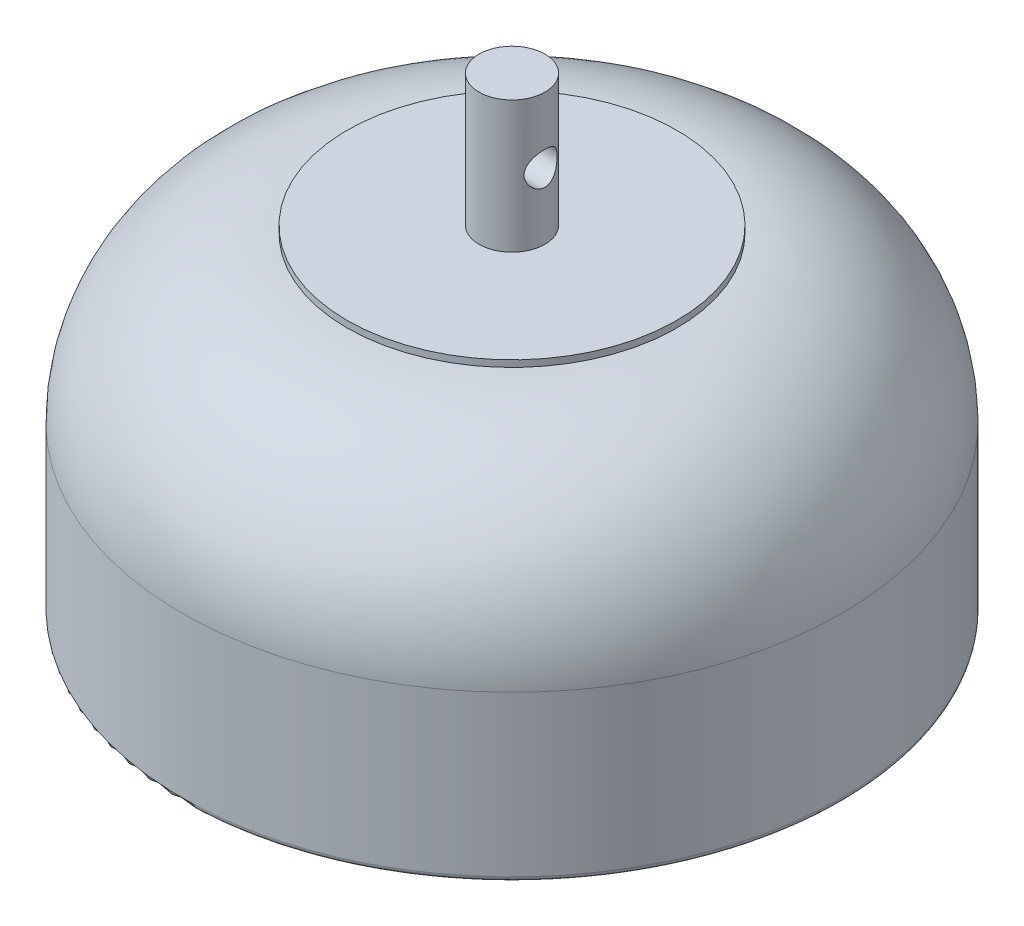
ISO-10303-21;
HEADER;
FILE_DESCRIPTION(('STEP AP214'),'2;1');
FILE_NAME('part.step','',(''),(''),'','','');
FILE_SCHEMA(('AUTOMOTIVE_DESIGN { 1 0 10303 214 1 1 1 1 }'));
ENDSEC;
DATA;
#1=APPLICATION_CONTEXT('core data for automotive mechanical design processes');
#2=APPLICATION_PROTOCOL_DEFINITION('international standard','automotive_design',2000,#1);
#3=PRODUCT_CONTEXT('',#1,'mechanical');
#4=PRODUCT('Part','Part','',(#3));
#5=PRODUCT_RELATED_PRODUCT_CATEGORY('part','',(#4));
#6=PRODUCT_DEFINITION_FORMATION('','',#4);
#7=PRODUCT_DEFINITION_CONTEXT('part definition',#1,'design');
#8=PRODUCT_DEFINITION('design','',#6,#7);
#9=PRODUCT_DEFINITION_SHAPE('','',#8);
#10=(LENGTH_UNIT() NAMED_UNIT(*) SI_UNIT(.MILLI.,.METRE.));
#11=(NAMED_UNIT(*) PLANE_ANGLE_UNIT() SI_UNIT($,.RADIAN.));
#12=(NAMED_UNIT(*) SI_UNIT($,.STERADIAN.) SOLID_ANGLE_UNIT());
#13=UNCERTAINTY_MEASURE_WITH_UNIT(LENGTH_MEASURE(1.E-05),#10,'distance_accuracy_value','');
#14=(GEOMETRIC_REPRESENTATION_CONTEXT(3) GLOBAL_UNCERTAINTY_ASSIGNED_CONTEXT((#13)) GLOBAL_UNIT_ASSIGNED_CONTEXT((#10,
#11,#12)) REPRESENTATION_CONTEXT('',''));
#15=CARTESIAN_POINT('',(0.,0.,0.));
#16=DIRECTION('',(0.,0.,1.));
#17=DIRECTION('',(1.,0.,0.));
#18=AXIS2_PLACEMENT_3D('',#15,#16,#17);
#19=CARTESIAN_POINT('',(0.,72.,0.));
#20=DIRECTION('',(0.,-1.,0.));
#21=DIRECTION('',(0.,0.,-1.));
#22=AXIS2_PLACEMENT_3D('',#19,#20,#21);
#23=CYLINDRICAL_SURFACE('',#22,10.);
#24=CARTESIAN_POINT('',(0.,72.,0.));
#25=DIRECTION('',(0.,1.,0.));
#26=DIRECTION('',(0.,0.,1.));
#27=AXIS2_PLACEMENT_3D('',#24,#25,#26);
#28=CIRCLE('',#27,10.);
#29=CARTESIAN_POINT('',(0.,72.,10.));
#30=VERTEX_POINT('',#29);
#31=EDGE_CURVE('E60',#30,#30,#28,.T.);
#32=ORIENTED_EDGE('',*,*,#31,.F.);
#33=EDGE_LOOP('',(#32));
#34=FACE_BOUND('',#33,.T.);
#35=CARTESIAN_POINT('',(0.,32.,0.));
#36=DIRECTION('',(0.,1.,0.));
#37=DIRECTION('',(0.,0.,1.));
#38=AXIS2_PLACEMENT_3D('',#35,#36,#37);
#39=CIRCLE('',#38,10.);
#40=CARTESIAN_POINT('',(0.,32.,10.));
#41=VERTEX_POINT('',#40);
#42=EDGE_CURVE('E11',#41,#41,#39,.T.);
#43=ORIENTED_EDGE('',*,*,#42,.T.);
#44=EDGE_LOOP('',(#43));
#45=FACE_BOUND('',#44,.T.);
#46=CARTESIAN_POINT('',(-8.66025403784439,52.,5.));
#47=CARTESIAN_POINT('',(-8.66025482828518,52.1303316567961,4.99999937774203));
#48=CARTESIAN_POINT('',(-8.66320639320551,52.2606749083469,4.99489703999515));
#49=CARTESIAN_POINT('',(-8.67490215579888,52.5203552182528,4.97455590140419));
#50=CARTESIAN_POINT('',(-8.68364905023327,52.6496917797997,4.95931238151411));
#51=CARTESIAN_POINT('',(-8.70662912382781,52.9065135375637,4.91885673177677));
#52=CARTESIAN_POINT('',(-8.72087090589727,53.033995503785,4.89362896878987));
#53=CARTESIAN_POINT('',(-8.75432466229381,53.2860174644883,4.83352579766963));
#54=CARTESIAN_POINT('',(-8.77353879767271,53.410556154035,4.79864619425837));
#55=CARTESIAN_POINT('',(-8.83745677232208,53.7771112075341,4.6805346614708));
#56=CARTESIAN_POINT('',(-8.88859880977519,54.0137323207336,4.58356144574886));
#57=CARTESIAN_POINT('',(-9.00213659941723,54.4671619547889,4.35632594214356));
#58=CARTESIAN_POINT('',(-9.06453296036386,54.6839694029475,4.22606185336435));
#59=CARTESIAN_POINT('',(-9.19984032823,55.1115106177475,3.92334549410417));
#60=CARTESIAN_POINT('',(-9.27319410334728,55.3202685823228,3.74829976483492));
#61=CARTESIAN_POINT('',(-9.41860822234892,55.7070690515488,3.36622943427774));
#62=CARTESIAN_POINT('',(-9.49066790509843,55.8850962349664,3.15918897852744));
#63=CARTESIAN_POINT('',(-9.59484443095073,56.1312264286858,2.82033206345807));
#64=CARTESIAN_POINT('',(-9.62993554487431,56.2119131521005,2.69838192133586));
#65=CARTESIAN_POINT('',(-9.69680156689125,56.3626286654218,2.44722131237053));
#66=CARTESIAN_POINT('',(-9.72857779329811,56.4326616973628,2.31801376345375));
#67=CARTESIAN_POINT('',(-9.78789520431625,56.5613762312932,2.05317391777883));
#68=CARTESIAN_POINT('',(-9.81543747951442,56.6200606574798,1.91754328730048));
#69=CARTESIAN_POINT('',(-9.86547242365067,56.7254310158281,1.64079696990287));
#70=CARTESIAN_POINT('',(-9.88796562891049,56.7721182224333,1.49968186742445));
#71=CARTESIAN_POINT('',(-9.92580359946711,56.8500155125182,1.2233043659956));
#72=CARTESIAN_POINT('',(-9.94154295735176,56.8820901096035,1.08833937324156));
#73=CARTESIAN_POINT('',(-9.96761571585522,56.9349664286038,0.815709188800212));
#74=CARTESIAN_POINT('',(-9.97794964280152,56.9557692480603,0.678044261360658));
#75=CARTESIAN_POINT('',(-9.99290900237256,56.9858199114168,0.40121705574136));
#76=CARTESIAN_POINT('',(-9.99753719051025,56.9950733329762,0.262055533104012));
#77=CARTESIAN_POINT('',(-10.0009568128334,57.0019143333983,-0.0166220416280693));
#78=CARTESIAN_POINT('',(-9.99974860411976,56.9995026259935,-0.156138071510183));
#79=CARTESIAN_POINT('',(-9.99189263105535,56.9837693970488,-0.422158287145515));
#80=CARTESIAN_POINT('',(-9.9857287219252,56.9714182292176,-0.548735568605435));
#81=CARTESIAN_POINT('',(-9.9687211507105,56.9371674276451,-0.800312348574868));
#82=CARTESIAN_POINT('',(-9.95787601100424,56.915264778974,-0.925311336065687));
#83=CARTESIAN_POINT('',(-9.93176736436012,56.8621537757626,-1.17280363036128));
#84=CARTESIAN_POINT('',(-9.91650533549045,56.8309485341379,-1.29529776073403));
#85=CARTESIAN_POINT('',(-9.88192155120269,56.7595523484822,-1.53706747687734));
#86=CARTESIAN_POINT('',(-9.86259824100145,56.7193579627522,-1.6563418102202));
#87=CARTESIAN_POINT('',(-9.79859222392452,56.5846254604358,-2.01140340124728));
#88=CARTESIAN_POINT('',(-9.74822622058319,56.4766310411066,-2.24122720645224));
#89=CARTESIAN_POINT('',(-9.63687815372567,56.2286703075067,-2.67992393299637));
#90=CARTESIAN_POINT('',(-9.57589229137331,56.088692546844,-2.88878931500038));
#91=CARTESIAN_POINT('',(-9.44222356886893,55.7655365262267,-3.30085071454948));
#92=CARTESIAN_POINT('',(-9.36897995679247,55.5795253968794,-3.50164452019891));
#93=CARTESIAN_POINT('',(-9.22270586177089,55.1770108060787,-3.87054772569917));
#94=CARTESIAN_POINT('',(-9.14967558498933,54.9604841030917,-4.03863197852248));
#95=CARTESIAN_POINT('',(-9.04390911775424,54.6088064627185,-4.2679539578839));
#96=CARTESIAN_POINT('',(-9.00829977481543,54.4829490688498,-4.34240098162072));
#97=CARTESIAN_POINT('',(-8.94051483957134,54.2244861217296,-4.48030007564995));
#98=CARTESIAN_POINT('',(-8.90833780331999,54.0918834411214,-4.54375677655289));
#99=CARTESIAN_POINT('',(-8.84860631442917,53.8207965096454,-4.65901104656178));
#100=CARTESIAN_POINT('',(-8.82104906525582,53.6823158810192,-4.71081567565));
#101=CARTESIAN_POINT('',(-8.7716484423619,53.4003786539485,-4.80217514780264));
#102=CARTESIAN_POINT('',(-8.74980428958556,53.2569227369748,-4.84173166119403));
#103=CARTESIAN_POINT('',(-8.71426171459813,52.9777430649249,-4.90539138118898));
#104=CARTESIAN_POINT('',(-8.7000553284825,52.8423062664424,-4.93047005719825));
#105=CARTESIAN_POINT('',(-8.67788216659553,52.5693280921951,-4.96939299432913));
#106=CARTESIAN_POINT('',(-8.66991462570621,52.4317869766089,-4.98323863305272));
#107=CARTESIAN_POINT('',(-8.66056020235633,52.1558845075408,-4.99947854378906));
#108=CARTESIAN_POINT('',(-8.65916956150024,52.01752366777,-5.00187935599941));
#109=CARTESIAN_POINT('',(-8.66301922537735,51.7411790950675,-4.99520900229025));
#110=CARTESIAN_POINT('',(-8.66825908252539,51.6031953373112,-4.98613861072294));
#111=CARTESIAN_POINT('',(-8.68421505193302,51.3439119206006,-4.95828928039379));
#112=CARTESIAN_POINT('',(-8.69426699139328,51.2224432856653,-4.94068517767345));
#113=CARTESIAN_POINT('',(-8.71910498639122,50.9815824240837,-4.89671673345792));
#114=CARTESIAN_POINT('',(-8.7338925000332,50.8621908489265,-4.87034969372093));
#115=CARTESIAN_POINT('',(-8.78469607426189,50.5082899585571,-4.77850297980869));
#116=CARTESIAN_POINT('',(-8.82716454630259,50.2778857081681,-4.70025914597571));
#117=CARTESIAN_POINT('',(-8.92681241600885,49.8229067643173,-4.50823244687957));
#118=CARTESIAN_POINT('',(-8.98458205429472,49.5990963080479,-4.39297142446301));
#119=CARTESIAN_POINT('',(-9.10780608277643,49.1726622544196,-4.1314342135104));
#120=CARTESIAN_POINT('',(-9.1732644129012,48.9700496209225,-3.9851420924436));
#121=CARTESIAN_POINT('',(-9.31439795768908,48.5651085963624,-3.64419701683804));
#122=CARTESIAN_POINT('',(-9.39032093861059,48.3660355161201,-3.44577250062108));
#123=CARTESIAN_POINT('',(-9.53671997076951,48.0029175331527,-3.01697632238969));
#124=CARTESIAN_POINT('',(-9.60719417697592,47.8388844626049,-2.78659391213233));
#125=CARTESIAN_POINT('',(-9.70419418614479,47.6209905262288,-2.41774074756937));
#126=CARTESIAN_POINT('',(-9.73542921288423,47.5523379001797,-2.28903769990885));
#127=CARTESIAN_POINT('',(-9.79367711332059,47.426243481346,-2.02535752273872));
#128=CARTESIAN_POINT('',(-9.82069185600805,47.3687967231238,-1.89038320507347));
#129=CARTESIAN_POINT('',(-9.86968940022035,47.2657820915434,-1.61516754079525));
#130=CARTESIAN_POINT('',(-9.89167460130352,47.2202085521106,-1.47492874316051));
#131=CARTESIAN_POINT('',(-9.92995088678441,47.1414909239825,-1.19024723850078));
#132=CARTESIAN_POINT('',(-9.94624264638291,47.1083453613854,-1.04580503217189));
#133=CARTESIAN_POINT('',(-9.97139931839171,47.0574049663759,-0.767401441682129));
#134=CARTESIAN_POINT('',(-9.98080865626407,47.0384803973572,-0.633694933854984));
#135=CARTESIAN_POINT('',(-9.99424478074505,47.0115065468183,-0.364924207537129));
#136=CARTESIAN_POINT('',(-9.9982719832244,47.0034564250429,-0.229860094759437));
#137=CARTESIAN_POINT('',(-10.0008314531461,46.9983368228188,0.0404881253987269));
#138=CARTESIAN_POINT('',(-9.999365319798,47.0012641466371,0.175772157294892));
#139=CARTESIAN_POINT('',(-9.99098333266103,47.0180525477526,0.445485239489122));
#140=CARTESIAN_POINT('',(-9.98406762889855,47.0319133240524,0.579914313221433));
#141=CARTESIAN_POINT('',(-9.96560870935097,47.0691176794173,0.838004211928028));
#142=CARTESIAN_POINT('',(-9.95440210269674,47.0917728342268,0.961788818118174));
#143=CARTESIAN_POINT('',(-9.92767317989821,47.1462131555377,1.20687032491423));
#144=CARTESIAN_POINT('',(-9.91214948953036,47.1780012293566,1.32816642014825));
#145=CARTESIAN_POINT('',(-9.859612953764,47.2866082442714,1.68709586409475));
#146=CARTESIAN_POINT('',(-9.81661817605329,47.3767019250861,1.91998814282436));
#147=CARTESIAN_POINT('',(-9.71629432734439,47.5936422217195,2.37715486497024));
#148=CARTESIAN_POINT('',(-9.65843082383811,47.7218959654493,2.60063468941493));
#149=CARTESIAN_POINT('',(-9.53440669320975,48.0097903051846,3.02386422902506));
#150=CARTESIAN_POINT('',(-9.46824226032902,48.169445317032,3.22360297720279));
#151=CARTESIAN_POINT('',(-9.32643278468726,48.5339751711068,3.61456788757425));
#152=CARTESIAN_POINT('',(-9.25049954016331,48.7417690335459,3.80296860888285));
#153=CARTESIAN_POINT('',(-9.1031442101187,49.1872970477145,4.14333626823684));
#154=CARTESIAN_POINT('',(-9.03172615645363,49.4250574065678,4.29527097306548));
#155=CARTESIAN_POINT('',(-8.93341291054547,49.8042196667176,4.49442606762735));
#156=CARTESIAN_POINT('',(-8.90168698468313,49.936626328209,4.55675683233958));
#157=CARTESIAN_POINT('',(-8.84287972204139,50.2072554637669,4.6698542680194));
#158=CARTESIAN_POINT('',(-8.81579599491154,50.3454748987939,4.72062689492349));
#159=CARTESIAN_POINT('',(-8.76742025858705,50.6264078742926,4.80987708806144));
#160=CARTESIAN_POINT('',(-8.74611337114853,50.7691087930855,4.8483862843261));
#161=CARTESIAN_POINT('',(-8.71014784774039,51.0580921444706,4.91270711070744));
#162=CARTESIAN_POINT('',(-8.69548456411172,51.2043719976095,4.93852761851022));
#163=CARTESIAN_POINT('',(-8.67647541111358,51.4589978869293,4.97182308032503));
#164=CARTESIAN_POINT('',(-8.67040719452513,51.5668242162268,4.98237929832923));
#165=CARTESIAN_POINT('',(-8.66229604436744,51.7830976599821,4.99646825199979));
#166=CARTESIAN_POINT('',(-8.66025338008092,51.8915448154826,5.00000051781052));
#167=CARTESIAN_POINT('',(-8.66025403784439,52.,5.));
#168=B_SPLINE_CURVE_WITH_KNOTS('',3,(#46,#47,#48,#49,#50,#51,#52,#53,#54,#55,#56,#57,#58,#59,
#60,#61,#62,#63,#64,#65,#66,#67,#68,#69,#70,#71,#72,#73,#74,#75,#76,#77,#78,#79,#80,#81,#82,#83,
#84,#85,#86,#87,#88,#89,#90,#91,#92,#93,#94,#95,#96,#97,#98,#99,#100,#101,#102,#103,#104,#105,
#106,#107,#108,#109,#110,#111,#112,#113,#114,#115,#116,#117,#118,#119,#120,#121,#122,#123,#124,
#125,#126,#127,#128,#129,#130,#131,#132,#133,#134,#135,#136,#137,#138,#139,#140,#141,#142,#143,
#144,#145,#146,#147,#148,#149,#150,#151,#152,#153,#154,#155,#156,#157,#158,#159,#160,#161,#162,
#163,#164,#165,#166,#167),.UNSPECIFIED.,.T.,.F.,(4,2,2,2,2,2,2,2,2,2,2,2,2,2,2,2,2,2,2,2,2,2,2,
2,2,2,2,2,2,2,2,2,2,2,2,2,2,2,2,2,2,2,2,2,2,2,2,2,2,2,2,2,2,2,2,2,2,2,2,2,4),(0.,
0.390882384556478,0.781946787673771,1.17362595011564,1.56547562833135,2.34415414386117,
3.12287479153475,3.96582272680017,4.80918971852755,5.25982992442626,5.71029022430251,
6.16063429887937,6.61093051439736,7.02920538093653,7.44743951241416,7.8654715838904,
8.28347807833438,8.66500933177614,9.0466611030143,9.42818530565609,9.80985583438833,
10.5829669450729,11.3563551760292,12.2028497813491,13.0499926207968,13.501002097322,
13.9518210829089,14.4023661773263,14.8528498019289,15.2676702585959,15.6824398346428,
16.0969723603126,16.5114769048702,16.8804871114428,17.2496110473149,17.9873544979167,
18.759266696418,19.5315761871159,20.4012390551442,21.2711951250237,21.7182117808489,
22.1650299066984,22.6116344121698,23.0581859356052,23.4637505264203,23.8692837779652,
24.2746989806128,24.6801030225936,25.0586722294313,25.4373620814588,26.1940875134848,
26.9831783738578,27.7726323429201,28.6406529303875,29.5094379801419,29.9581473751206,
30.4066250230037,30.8539364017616,31.3009343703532,31.626184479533,31.9514563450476),.UNSPECIFIED.);
#169=CARTESIAN_POINT('',(-8.66025403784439,52.,5.));
#170=VERTEX_POINT('',#169);
#171=EDGE_CURVE('E63',#170,#170,#168,.T.);
#172=ORIENTED_EDGE('',*,*,#171,.F.);
#173=EDGE_LOOP('',(#172));
#174=FACE_BOUND('',#173,.T.);
#175=CARTESIAN_POINT('',(8.66025403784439,52.,5.));
#176=CARTESIAN_POINT('',(8.66025482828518,51.869668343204,4.99999937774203));
#177=CARTESIAN_POINT('',(8.66320639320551,51.7393250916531,4.99489703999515));
#178=CARTESIAN_POINT('',(8.67490215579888,51.4796447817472,4.97455590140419));
#179=CARTESIAN_POINT('',(8.68364905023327,51.3503082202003,4.95931238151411));
#180=CARTESIAN_POINT('',(8.70662912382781,51.0934864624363,4.91885673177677));
#181=CARTESIAN_POINT('',(8.72087090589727,50.966004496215,4.89362896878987));
#182=CARTESIAN_POINT('',(8.75432466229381,50.7139825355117,4.83352579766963));
#183=CARTESIAN_POINT('',(8.77353879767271,50.589443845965,4.79864619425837));
#184=CARTESIAN_POINT('',(8.83745677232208,50.2228887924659,4.6805346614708));
#185=CARTESIAN_POINT('',(8.88859880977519,49.9862676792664,4.58356144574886));
#186=CARTESIAN_POINT('',(9.00213659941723,49.5328380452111,4.35632594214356));
#187=CARTESIAN_POINT('',(9.06453296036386,49.3160305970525,4.22606185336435));
#188=CARTESIAN_POINT('',(9.19984032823,48.8884893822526,3.92334549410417));
#189=CARTESIAN_POINT('',(9.27319410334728,48.6797314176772,3.74829976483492));
#190=CARTESIAN_POINT('',(9.41860822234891,48.2929309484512,3.36622943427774));
#191=CARTESIAN_POINT('',(9.49066790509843,48.1149037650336,3.15918897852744));
#192=CARTESIAN_POINT('',(9.59484443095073,47.8687735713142,2.82033206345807));
#193=CARTESIAN_POINT('',(9.62993554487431,47.7880868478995,2.69838192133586));
#194=CARTESIAN_POINT('',(9.69680156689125,47.6373713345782,2.44722131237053));
#195=CARTESIAN_POINT('',(9.72857779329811,47.5673383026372,2.31801376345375));
#196=CARTESIAN_POINT('',(9.78789520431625,47.4386237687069,2.05317391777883));
#197=CARTESIAN_POINT('',(9.81543747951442,47.3799393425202,1.91754328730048));
#198=CARTESIAN_POINT('',(9.86547242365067,47.2745689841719,1.64079696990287));
#199=CARTESIAN_POINT('',(9.88796562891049,47.2278817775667,1.49968186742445));
#200=CARTESIAN_POINT('',(9.92580359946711,47.1499844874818,1.2233043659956));
#201=CARTESIAN_POINT('',(9.94154295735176,47.1179098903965,1.08833937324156));
#202=CARTESIAN_POINT('',(9.96761571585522,47.0650335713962,0.815709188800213));
#203=CARTESIAN_POINT('',(9.97794964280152,47.0442307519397,0.678044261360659));
#204=CARTESIAN_POINT('',(9.99290900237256,47.0141800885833,0.401217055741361));
#205=CARTESIAN_POINT('',(9.99753719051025,47.0049266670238,0.262055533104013));
#206=CARTESIAN_POINT('',(10.0009568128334,46.9980856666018,-0.0166220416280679));
#207=CARTESIAN_POINT('',(9.99974860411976,47.0004973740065,-0.156138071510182));
#208=CARTESIAN_POINT('',(9.99189263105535,47.0162306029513,-0.422158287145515));
#209=CARTESIAN_POINT('',(9.9857287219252,47.0285817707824,-0.548735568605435));
#210=CARTESIAN_POINT('',(9.9687211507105,47.062832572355,-0.800312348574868));
#211=CARTESIAN_POINT('',(9.95787601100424,47.084735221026,-0.925311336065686));
#212=CARTESIAN_POINT('',(9.93176736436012,47.1378462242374,-1.17280363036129));
#213=CARTESIAN_POINT('',(9.91650533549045,47.1690514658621,-1.29529776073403));
#214=CARTESIAN_POINT('',(9.88192155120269,47.2404476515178,-1.53706747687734));
#215=CARTESIAN_POINT('',(9.86259824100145,47.2806420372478,-1.6563418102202));
#216=CARTESIAN_POINT('',(9.79859222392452,47.4153745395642,-2.01140340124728));
#217=CARTESIAN_POINT('',(9.74822622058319,47.5233689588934,-2.24122720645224));
#218=CARTESIAN_POINT('',(9.63687815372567,47.7713296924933,-2.67992393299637));
#219=CARTESIAN_POINT('',(9.57589229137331,47.911307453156,-2.88878931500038));
#220=CARTESIAN_POINT('',(9.44222356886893,48.2344634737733,-3.30085071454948));
#221=CARTESIAN_POINT('',(9.36897995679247,48.4204746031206,-3.50164452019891));
#222=CARTESIAN_POINT('',(9.22270586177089,48.8229891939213,-3.87054772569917));
#223=CARTESIAN_POINT('',(9.14967558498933,49.0395158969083,-4.03863197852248));
#224=CARTESIAN_POINT('',(9.04390911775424,49.3911935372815,-4.2679539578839));
#225=CARTESIAN_POINT('',(9.00829977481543,49.5170509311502,-4.34240098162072));
#226=CARTESIAN_POINT('',(8.94051483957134,49.7755138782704,-4.48030007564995));
#227=CARTESIAN_POINT('',(8.90833780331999,49.9081165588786,-4.54375677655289));
#228=CARTESIAN_POINT('',(8.84860631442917,50.1792034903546,-4.65901104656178));
#229=CARTESIAN_POINT('',(8.82104906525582,50.3176841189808,-4.71081567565));
#230=CARTESIAN_POINT('',(8.7716484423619,50.5996213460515,-4.80217514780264));
#231=CARTESIAN_POINT('',(8.74980428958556,50.7430772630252,-4.84173166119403));
#232=CARTESIAN_POINT('',(8.71426171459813,51.0222569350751,-4.90539138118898));
#233=CARTESIAN_POINT('',(8.7000553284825,51.1576937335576,-4.93047005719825));
#234=CARTESIAN_POINT('',(8.67788216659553,51.4306719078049,-4.96939299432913));
#235=CARTESIAN_POINT('',(8.66991462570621,51.5682130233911,-4.98323863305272));
#236=CARTESIAN_POINT('',(8.66056020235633,51.8441154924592,-4.99947854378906));
#237=CARTESIAN_POINT('',(8.65916956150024,51.98247633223,-5.00187935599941));
#238=CARTESIAN_POINT('',(8.66301922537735,52.2588209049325,-4.99520900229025));
#239=CARTESIAN_POINT('',(8.66825908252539,52.3968046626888,-4.98613861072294));
#240=CARTESIAN_POINT('',(8.68421505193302,52.6560880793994,-4.95828928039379));
#241=CARTESIAN_POINT('',(8.69426699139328,52.7775567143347,-4.94068517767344));
#242=CARTESIAN_POINT('',(8.71910498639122,53.0184175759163,-4.89671673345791));
#243=CARTESIAN_POINT('',(8.7338925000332,53.1378091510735,-4.87034969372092));
#244=CARTESIAN_POINT('',(8.78469607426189,53.4917100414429,-4.77850297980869));
#245=CARTESIAN_POINT('',(8.82716454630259,53.7221142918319,-4.70025914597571));
#246=CARTESIAN_POINT('',(8.92681241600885,54.1770932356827,-4.50823244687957));
#247=CARTESIAN_POINT('',(8.98458205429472,54.4009036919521,-4.39297142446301));
#248=CARTESIAN_POINT('',(9.10780608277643,54.8273377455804,-4.1314342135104));
#249=CARTESIAN_POINT('',(9.1732644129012,55.0299503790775,-3.9851420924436));
#250=CARTESIAN_POINT('',(9.31439795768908,55.4348914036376,-3.64419701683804));
#251=CARTESIAN_POINT('',(9.39032093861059,55.6339644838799,-3.44577250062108));
#252=CARTESIAN_POINT('',(9.53671997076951,55.9970824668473,-3.01697632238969));
#253=CARTESIAN_POINT('',(9.60719417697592,56.1611155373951,-2.78659391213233));
#254=CARTESIAN_POINT('',(9.70419418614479,56.3790094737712,-2.41774074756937));
#255=CARTESIAN_POINT('',(9.73542921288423,56.4476620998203,-2.28903769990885));
#256=CARTESIAN_POINT('',(9.79367711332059,56.5737565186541,-2.02535752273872));
#257=CARTESIAN_POINT('',(9.82069185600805,56.6312032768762,-1.89038320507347));
#258=CARTESIAN_POINT('',(9.86968940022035,56.7342179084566,-1.61516754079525));
#259=CARTESIAN_POINT('',(9.89167460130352,56.7797914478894,-1.47492874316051));
#260=CARTESIAN_POINT('',(9.92995088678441,56.8585090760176,-1.19024723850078));
#261=CARTESIAN_POINT('',(9.94624264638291,56.8916546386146,-1.04580503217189));
#262=CARTESIAN_POINT('',(9.97139931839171,56.9425950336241,-0.767401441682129));
#263=CARTESIAN_POINT('',(9.98080865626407,56.9615196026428,-0.633694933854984));
#264=CARTESIAN_POINT('',(9.99424478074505,56.9884934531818,-0.364924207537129));
#265=CARTESIAN_POINT('',(9.9982719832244,56.9965435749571,-0.229860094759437));
#266=CARTESIAN_POINT('',(10.0008314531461,57.0016631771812,0.0404881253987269));
#267=CARTESIAN_POINT('',(9.999365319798,56.9987358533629,0.175772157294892));
#268=CARTESIAN_POINT('',(9.99098333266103,56.9819474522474,0.445485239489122));
#269=CARTESIAN_POINT('',(9.98406762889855,56.9680866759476,0.579914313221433));
#270=CARTESIAN_POINT('',(9.96560870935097,56.9308823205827,0.838004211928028));
#271=CARTESIAN_POINT('',(9.95440210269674,56.9082271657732,0.961788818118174));
#272=CARTESIAN_POINT('',(9.92767317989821,56.8537868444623,1.20687032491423));
#273=CARTESIAN_POINT('',(9.91214948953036,56.8219987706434,1.32816642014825));
#274=CARTESIAN_POINT('',(9.859612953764,56.7133917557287,1.68709586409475));
#275=CARTESIAN_POINT('',(9.81661817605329,56.6232980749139,1.91998814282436));
#276=CARTESIAN_POINT('',(9.71629432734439,56.4063577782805,2.37715486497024));
#277=CARTESIAN_POINT('',(9.65843082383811,56.2781040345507,2.60063468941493));
#278=CARTESIAN_POINT('',(9.53440669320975,55.9902096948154,3.02386422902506));
#279=CARTESIAN_POINT('',(9.46824226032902,55.830554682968,3.22360297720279));
#280=CARTESIAN_POINT('',(9.32643278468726,55.4660248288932,3.61456788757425));
#281=CARTESIAN_POINT('',(9.25049954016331,55.2582309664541,3.80296860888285));
#282=CARTESIAN_POINT('',(9.1031442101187,54.8127029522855,4.14333626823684));
#283=CARTESIAN_POINT('',(9.03172615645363,54.5749425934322,4.29527097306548));
#284=CARTESIAN_POINT('',(8.93341291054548,54.1957803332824,4.49442606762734));
#285=CARTESIAN_POINT('',(8.90168698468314,54.063373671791,4.55675683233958));
#286=CARTESIAN_POINT('',(8.8428797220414,53.7927445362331,4.66985426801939));
#287=CARTESIAN_POINT('',(8.81579599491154,53.6545251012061,4.72062689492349));
#288=CARTESIAN_POINT('',(8.76742025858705,53.3735921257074,4.80987708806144));
#289=CARTESIAN_POINT('',(8.74611337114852,53.2308912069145,4.8483862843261));
#290=CARTESIAN_POINT('',(8.71014784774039,52.9419078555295,4.91270711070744));
#291=CARTESIAN_POINT('',(8.69548456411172,52.7956280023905,4.93852761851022));
#292=CARTESIAN_POINT('',(8.67647541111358,52.5410021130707,4.97182308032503));
#293=CARTESIAN_POINT('',(8.67040719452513,52.4331757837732,4.98237929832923));
#294=CARTESIAN_POINT('',(8.66229604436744,52.2169023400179,4.99646825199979));
#295=CARTESIAN_POINT('',(8.66025338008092,52.1084551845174,5.00000051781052));
#296=CARTESIAN_POINT('',(8.66025403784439,52.,5.));
#297=B_SPLINE_CURVE_WITH_KNOTS('',3,(#175,#176,#177,#178,#179,#180,#181,#182,#183,#184,#185,
#186,#187,#188,#189,#190,#191,#192,#193,#194,#195,#196,#197,#198,#199,#200,#201,#202,#203,#204,
#205,#206,#207,#208,#209,#210,#211,#212,#213,#214,#215,#216,#217,#218,#219,#220,#221,#222,#223,
#224,#225,#226,#227,#228,#229,#230,#231,#232,#233,#234,#235,#236,#237,#238,#239,#240,#241,#242,
#243,#244,#245,#246,#247,#248,#249,#250,#251,#252,#253,#254,#255,#256,#257,#258,#259,#260,#261,
#262,#263,#264,#265,#266,#267,#268,#269,#270,#271,#272,#273,#274,#275,#276,#277,#278,#279,#280,
#281,#282,#283,#284,#285,#286,#287,#288,#289,#290,#291,#292,#293,#294,#295,#296),.UNSPECIFIED.,
.T.,.F.,(4,2,2,2,2,2,2,2,2,2,2,2,2,2,2,2,2,2,2,2,2,2,2,2,2,2,2,2,2,2,2,2,2,2,2,2,2,2,2,2,2,2,2,
2,2,2,2,2,2,2,2,2,2,2,2,2,2,2,2,2,4),(0.,0.390882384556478,0.781946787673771,1.17362595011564,
1.56547562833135,2.34415414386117,3.12287479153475,3.96582272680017,4.80918971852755,
5.25982992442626,5.71029022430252,6.16063429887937,6.61093051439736,7.02920538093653,
7.44743951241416,7.8654715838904,8.28347807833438,8.66500933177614,9.0466611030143,
9.4281853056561,9.80985583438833,10.5829669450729,11.3563551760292,12.2028497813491,
13.0499926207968,13.501002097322,13.9518210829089,14.4023661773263,14.8528498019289,
15.2676702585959,15.6824398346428,16.0969723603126,16.5114769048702,16.8804871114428,
17.2496110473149,17.9873544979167,18.759266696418,19.5315761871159,20.4012390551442,
21.2711951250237,21.7182117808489,22.1650299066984,22.6116344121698,23.0581859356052,
23.4637505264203,23.8692837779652,24.2746989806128,24.6801030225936,25.0586722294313,
25.4373620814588,26.1940875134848,26.9831783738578,27.7726323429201,28.6406529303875,
29.5094379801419,29.9581473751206,30.4066250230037,30.8539364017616,31.3009343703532,
31.626184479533,31.9514563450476),.UNSPECIFIED.);
#298=CARTESIAN_POINT('',(8.66025403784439,52.,5.));
#299=VERTEX_POINT('',#298);
#300=EDGE_CURVE('E43',#299,#299,#297,.T.);
#301=ORIENTED_EDGE('',*,*,#300,.F.);
#302=EDGE_LOOP('',(#301));
#303=FACE_BOUND('',#302,.T.);
#304=ADVANCED_FACE('F39',(#34,#45,#174,#303),#23,.T.);
#305=CARTESIAN_POINT('',(0.,32.,0.));
#306=DIRECTION('',(0.,-1.,0.));
#307=DIRECTION('',(0.,0.,-1.));
#308=AXIS2_PLACEMENT_3D('',#305,#306,#307);
#309=CYLINDRICAL_SURFACE('',#308,50.);
#310=CARTESIAN_POINT('',(0.,32.,0.));
#311=DIRECTION('',(0.,1.,0.));
#312=DIRECTION('',(0.,0.,1.));
#313=AXIS2_PLACEMENT_3D('',#310,#311,#312);
#314=CIRCLE('',#313,50.);
#315=CARTESIAN_POINT('',(0.,32.,50.));
#316=VERTEX_POINT('',#315);
#317=EDGE_CURVE('E52',#316,#316,#314,.T.);
#318=ORIENTED_EDGE('',*,*,#317,.F.);
#319=EDGE_LOOP('',(#318));
#320=FACE_BOUND('',#319,.T.);
#321=CARTESIAN_POINT('',(0.,30.,0.));
#322=DIRECTION('',(0.,1.,0.));
#323=DIRECTION('',(0.,0.,1.));
#324=AXIS2_PLACEMENT_3D('',#321,#322,#323);
#325=CIRCLE('',#324,50.);
#326=CARTESIAN_POINT('',(0.,30.,50.));
#327=VERTEX_POINT('',#326);
#328=EDGE_CURVE('E57',#327,#327,#325,.T.);
#329=ORIENTED_EDGE('',*,*,#328,.T.);
#330=EDGE_LOOP('',(#329));
#331=FACE_BOUND('',#330,.T.);
#332=ADVANCED_FACE('F41',(#320,#331),#309,.T.);
#333=CARTESIAN_POINT('',(0.,32.,0.));
#334=DIRECTION('',(0.,1.,0.));
#335=DIRECTION('',(0.,0.,1.));
#336=AXIS2_PLACEMENT_3D('',#333,#334,#335);
#337=PLANE('',#336);
#338=ORIENTED_EDGE('',*,*,#42,.F.);
#339=EDGE_LOOP('',(#338));
#340=FACE_BOUND('',#339,.T.);
#341=ORIENTED_EDGE('',*,*,#317,.T.);
#342=EDGE_LOOP('',(#341));
#343=FACE_BOUND('',#342,.T.);
#344=ADVANCED_FACE('F84',(#340,#343),#337,.T.);
#345=CARTESIAN_POINT('',(0.,30.,0.));
#346=DIRECTION('',(0.,1.,0.));
#347=DIRECTION('',(0.,0.,1.));
#348=AXIS2_PLACEMENT_3D('',#345,#346,#347);
#349=PLANE('',#348);
#350=ORIENTED_EDGE('',*,*,#328,.F.);
#351=EDGE_LOOP('',(#350));
#352=FACE_BOUND('',#351,.T.);
#353=ADVANCED_FACE('F78',(#352),#349,.F.);
#354=CARTESIAN_POINT('',(0.,72.,0.));
#355=DIRECTION('',(0.,1.,0.));
#356=DIRECTION('',(0.,0.,1.));
#357=AXIS2_PLACEMENT_3D('',#354,#355,#356);
#358=PLANE('',#357);
#359=ORIENTED_EDGE('',*,*,#31,.T.);
#360=EDGE_LOOP('',(#359));
#361=FACE_BOUND('',#360,.T.);
#362=ADVANCED_FACE('F74',(#361),#358,.T.);
#363=CARTESIAN_POINT('',(20.,52.,0.));
#364=DIRECTION('',(-1.,0.,0.));
#365=DIRECTION('',(0.,0.,1.));
#366=AXIS2_PLACEMENT_3D('',#363,#364,#365);
#367=CYLINDRICAL_SURFACE('',#366,5.);
#368=ORIENTED_EDGE('',*,*,#171,.T.);
#369=EDGE_LOOP('',(#368));
#370=FACE_BOUND('',#369,.T.);
#371=ORIENTED_EDGE('',*,*,#300,.T.);
#372=EDGE_LOOP('',(#371));
#373=FACE_BOUND('',#372,.T.);
#374=ADVANCED_FACE('F71',(#370,#373),#367,.F.);
#375=CLOSED_SHELL('',(#304,#332,#344,#353,#362,#374));
#376=MANIFOLD_SOLID_BREP('B2',#375);
#377=CARTESIAN_POINT('',(0.,-10.,0.));
#378=DIRECTION('',(0.,1.,0.));
#379=DIRECTION('',(0.,0.,1.));
#380=AXIS2_PLACEMENT_3D('',#377,#378,#379);
#381=CYLINDRICAL_SURFACE('',#380,50.);
#382=CARTESIAN_POINT('',(0.,0.,0.));
#383=DIRECTION('',(0.,-1.,0.));
#384=DIRECTION('',(0.,0.,-1.));
#385=AXIS2_PLACEMENT_3D('',#382,#383,#384);
#386=CIRCLE('',#385,50.);
#387=CARTESIAN_POINT('',(0.,0.,-50.));
#388=VERTEX_POINT('',#387);
#389=EDGE_CURVE('E38',#388,#388,#386,.F.);
#390=ORIENTED_EDGE('',*,*,#389,.T.);
#391=EDGE_LOOP('',(#390));
#392=FACE_BOUND('',#391,.T.);
#393=CARTESIAN_POINT('',(0.,5.,0.));
#394=DIRECTION('',(0.,-1.,0.));
#395=DIRECTION('',(0.,0.,-1.));
#396=AXIS2_PLACEMENT_3D('',#393,#394,#395);
#397=CIRCLE('',#396,50.);
#398=CARTESIAN_POINT('',(0.,5.,-50.));
#399=VERTEX_POINT('',#398);
#400=EDGE_CURVE('E159',#399,#399,#397,.T.);
#401=ORIENTED_EDGE('',*,*,#400,.T.);
#402=EDGE_LOOP('',(#401));
#403=FACE_BOUND('',#402,.T.);
#404=ADVANCED_FACE('F148',(#392,#403),#381,.T.);
#405=CARTESIAN_POINT('',(0.,-10.,0.));
#406=DIRECTION('',(0.,-1.,0.));
#407=DIRECTION('',(0.,0.,-1.));
#408=AXIS2_PLACEMENT_3D('',#405,#406,#407);
#409=PLANE('',#408);
#410=CARTESIAN_POINT('',(0.,-10.,0.));
#411=DIRECTION('',(0.,-1.,0.));
#412=DIRECTION('',(0.,0.,-1.));
#413=AXIS2_PLACEMENT_3D('',#410,#411,#412);
#414=CIRCLE('',#413,40.);
#415=CARTESIAN_POINT('',(0.,-10.,-40.));
#416=VERTEX_POINT('',#415);
#417=EDGE_CURVE('E155',#416,#416,#414,.T.);
#418=ORIENTED_EDGE('',*,*,#417,.T.);
#419=EDGE_LOOP('',(#418));
#420=FACE_BOUND('',#419,.T.);
#421=ADVANCED_FACE('F169',(#420),#409,.T.);
#422=CARTESIAN_POINT('',(0.,5.,0.));
#423=DIRECTION('',(0.,-1.,0.));
#424=DIRECTION('',(0.,0.,-1.));
#425=AXIS2_PLACEMENT_3D('',#422,#423,#424);
#426=PLANE('',#425);
#427=ORIENTED_EDGE('',*,*,#400,.F.);
#428=EDGE_LOOP('',(#427));
#429=FACE_BOUND('',#428,.T.);
#430=ADVANCED_FACE('F167',(#429),#426,.F.);
#431=CARTESIAN_POINT('',(0.,0.,0.));
#432=DIRECTION('',(0.,-1.,0.));
#433=DIRECTION('',(0.,0.,-1.));
#434=AXIS2_PLACEMENT_3D('',#431,#432,#433);
#435=TOROIDAL_SURFACE('',#434,40.,10.);
#436=ORIENTED_EDGE('',*,*,#389,.F.);
#437=EDGE_LOOP('',(#436));
#438=FACE_BOUND('',#437,.T.);
#439=ORIENTED_EDGE('',*,*,#417,.F.);
#440=EDGE_LOOP('',(#439));
#441=FACE_BOUND('',#440,.T.);
#442=ADVANCED_FACE('F150',(#438,#441),#435,.T.);
#443=CLOSED_SHELL('',(#404,#421,#430,#442));
#444=MANIFOLD_SOLID_BREP('B6',#443);
#445=CARTESIAN_POINT('',(0.,5.,0.));
#446=DIRECTION('',(0.,1.,0.));
#447=DIRECTION('',(0.,0.,1.));
#448=AXIS2_PLACEMENT_3D('',#445,#446,#447);
#449=CYLINDRICAL_SURFACE('',#448,50.);
#450=CARTESIAN_POINT('',(0.,5.,0.));
#451=DIRECTION('',(0.,-1.,0.));
#452=DIRECTION('',(0.,0.,-1.));
#453=AXIS2_PLACEMENT_3D('',#450,#451,#452);
#454=CIRCLE('',#453,50.);
#455=CARTESIAN_POINT('',(0.,5.,-50.));
#456=VERTEX_POINT('',#455);
#457=EDGE_CURVE('E147',#456,#456,#454,.T.);
#458=ORIENTED_EDGE('',*,*,#457,.F.);
#459=EDGE_LOOP('',(#458));
#460=FACE_BOUND('',#459,.T.);
#461=CARTESIAN_POINT('',(0.,25.,0.));
#462=DIRECTION('',(0.,-1.,0.));
#463=DIRECTION('',(0.,0.,-1.));
#464=AXIS2_PLACEMENT_3D('',#461,#462,#463);
#465=CIRCLE('',#464,50.);
#466=CARTESIAN_POINT('',(0.,25.,-50.));
#467=VERTEX_POINT('',#466);
#468=EDGE_CURVE('E214',#467,#467,#465,.T.);
#469=ORIENTED_EDGE('',*,*,#468,.T.);
#470=EDGE_LOOP('',(#469));
#471=FACE_BOUND('',#470,.T.);
#472=ADVANCED_FACE('F211',(#460,#471),#449,.T.);
#473=CARTESIAN_POINT('',(0.,5.,0.));
#474=DIRECTION('',(0.,-1.,0.));
#475=DIRECTION('',(0.,0.,-1.));
#476=AXIS2_PLACEMENT_3D('',#473,#474,#475);
#477=PLANE('',#476);
#478=ORIENTED_EDGE('',*,*,#457,.T.);
#479=EDGE_LOOP('',(#478));
#480=FACE_BOUND('',#479,.T.);
#481=ADVANCED_FACE('F226',(#480),#477,.T.);
#482=CARTESIAN_POINT('',(0.,25.,0.));
#483=DIRECTION('',(0.,-1.,0.));
#484=DIRECTION('',(0.,0.,-1.));
#485=AXIS2_PLACEMENT_3D('',#482,#483,#484);
#486=PLANE('',#485);
#487=ORIENTED_EDGE('',*,*,#468,.F.);
#488=EDGE_LOOP('',(#487));
#489=FACE_BOUND('',#488,.T.);
#490=ADVANCED_FACE('F224',(#489),#486,.F.);
#491=CLOSED_SHELL('',(#472,#481,#490));
#492=MANIFOLD_SOLID_BREP('B33',#491);
#493=CARTESIAN_POINT('',(0.,25.,0.));
#494=DIRECTION('',(0.,1.,0.));
#495=DIRECTION('',(0.,0.,1.));
#496=AXIS2_PLACEMENT_3D('',#493,#494,#495);
#497=CYLINDRICAL_SURFACE('',#496,50.);
#498=CARTESIAN_POINT('',(0.,25.,0.));
#499=DIRECTION('',(0.,-1.,0.));
#500=DIRECTION('',(0.,0.,-1.));
#501=AXIS2_PLACEMENT_3D('',#498,#499,#500);
#502=CIRCLE('',#501,50.);
#503=CARTESIAN_POINT('',(0.,25.,-50.));
#504=VERTEX_POINT('',#503);
#505=EDGE_CURVE('E210',#504,#504,#502,.T.);
#506=ORIENTED_EDGE('',*,*,#505,.F.);
#507=EDGE_LOOP('',(#506));
#508=FACE_BOUND('',#507,.T.);
#509=CARTESIAN_POINT('',(0.,27.,0.));
#510=DIRECTION('',(0.,-1.,0.));
#511=DIRECTION('',(0.,0.,-1.));
#512=AXIS2_PLACEMENT_3D('',#509,#510,#511);
#513=CIRCLE('',#512,50.);
#514=CARTESIAN_POINT('',(0.,27.,-50.));
#515=VERTEX_POINT('',#514);
#516=EDGE_CURVE('E261',#515,#515,#513,.T.);
#517=ORIENTED_EDGE('',*,*,#516,.T.);
#518=EDGE_LOOP('',(#517));
#519=FACE_BOUND('',#518,.T.);
#520=ADVANCED_FACE('F258',(#508,#519),#497,.T.);
#521=CARTESIAN_POINT('',(0.,25.,0.));
#522=DIRECTION('',(0.,-1.,0.));
#523=DIRECTION('',(0.,0.,-1.));
#524=AXIS2_PLACEMENT_3D('',#521,#522,#523);
#525=PLANE('',#524);
#526=ORIENTED_EDGE('',*,*,#505,.T.);
#527=EDGE_LOOP('',(#526));
#528=FACE_BOUND('',#527,.T.);
#529=ADVANCED_FACE('F273',(#528),#525,.T.);
#530=CARTESIAN_POINT('',(0.,27.,0.));
#531=DIRECTION('',(0.,-1.,0.));
#532=DIRECTION('',(0.,0.,-1.));
#533=AXIS2_PLACEMENT_3D('',#530,#531,#532);
#534=PLANE('',#533);
#535=ORIENTED_EDGE('',*,*,#516,.F.);
#536=EDGE_LOOP('',(#535));
#537=FACE_BOUND('',#536,.T.);
#538=ADVANCED_FACE('F271',(#537),#534,.F.);
#539=CLOSED_SHELL('',(#520,#529,#538));
#540=MANIFOLD_SOLID_BREP('B142',#539);
#541=CARTESIAN_POINT('',(50.,30.,0.));
#542=DIRECTION('',(0.,-1.,0.));
#543=DIRECTION('',(1.,0.,0.));
#544=AXIS2_PLACEMENT_3D('',#541,#542,#543);
#545=PLANE('',#544);
#546=CARTESIAN_POINT('',(0.,30.,0.));
#547=DIRECTION('',(0.,1.,0.));
#548=DIRECTION('',(-1.,0.,0.));
#549=AXIS2_PLACEMENT_3D('',#546,#547,#548);
#550=CIRCLE('',#549,50.);
#551=CARTESIAN_POINT('',(-50.,30.,0.));
#552=VERTEX_POINT('',#551);
#553=EDGE_CURVE('E310',#552,#552,#550,.T.);
#554=ORIENTED_EDGE('',*,*,#553,.T.);
#555=EDGE_LOOP('',(#554));
#556=FACE_BOUND('',#555,.T.);
#557=ADVANCED_FACE('F298',(#556),#545,.F.);
#558=CARTESIAN_POINT('',(0.,-20.,0.));
#559=DIRECTION('',(0.,1.,0.));
#560=DIRECTION('',(-1.,0.,0.));
#561=AXIS2_PLACEMENT_3D('',#558,#559,#560);
#562=DEGENERATE_TOROIDAL_SURFACE('',#561,50.,50.,.T.);
#563=ORIENTED_EDGE('',*,*,#553,.F.);
#564=EDGE_LOOP('',(#563));
#565=FACE_BOUND('',#564,.T.);
#566=CARTESIAN_POINT('',(0.,-20.,0.));
#567=DIRECTION('',(0.,1.,0.));
#568=DIRECTION('',(-1.,0.,0.));
#569=AXIS2_PLACEMENT_3D('',#566,#567,#568);
#570=CIRCLE('',#569,100.);
#571=CARTESIAN_POINT('',(-100.,-20.,0.));
#572=VERTEX_POINT('',#571);
#573=EDGE_CURVE('E315',#572,#572,#570,.T.);
#574=ORIENTED_EDGE('',*,*,#573,.T.);
#575=EDGE_LOOP('',(#574));
#576=FACE_BOUND('',#575,.T.);
#577=ADVANCED_FACE('F338',(#565,#576),#562,.T.);
#578=CARTESIAN_POINT('',(0.,30.,0.));
#579=DIRECTION('',(0.,1.,0.));
#580=DIRECTION('',(-1.,0.,0.));
#581=AXIS2_PLACEMENT_3D('',#578,#579,#580);
#582=CYLINDRICAL_SURFACE('',#581,100.);
#583=CARTESIAN_POINT('',(0.,-68.5,0.));
#584=DIRECTION('',(0.,1.,0.));
#585=DIRECTION('',(-1.,0.,0.));
#586=AXIS2_PLACEMENT_3D('',#583,#584,#585);
#587=CIRCLE('',#586,100.);
#588=CARTESIAN_POINT('',(-100.,-68.5,0.));
#589=VERTEX_POINT('',#588);
#590=EDGE_CURVE('E306',#589,#589,#587,.T.);
#591=ORIENTED_EDGE('',*,*,#590,.T.);
#592=EDGE_LOOP('',(#591));
#593=FACE_BOUND('',#592,.T.);
#594=ORIENTED_EDGE('',*,*,#573,.F.);
#595=EDGE_LOOP('',(#594));
#596=FACE_BOUND('',#595,.T.);
#597=ADVANCED_FACE('F330',(#593,#596),#582,.T.);
#598=CARTESIAN_POINT('',(50.,27.,0.));
#599=DIRECTION('',(0.,-1.,0.));
#600=DIRECTION('',(1.,0.,0.));
#601=AXIS2_PLACEMENT_3D('',#598,#599,#600);
#602=PLANE('',#601);
#603=CARTESIAN_POINT('',(0.,27.,0.));
#604=DIRECTION('',(0.,1.,0.));
#605=DIRECTION('',(-1.,0.,0.));
#606=AXIS2_PLACEMENT_3D('',#603,#604,#605);
#607=CIRCLE('',#606,50.);
#608=CARTESIAN_POINT('',(-50.,27.,0.));
#609=VERTEX_POINT('',#608);
#610=EDGE_CURVE('E318',#609,#609,#607,.T.);
#611=ORIENTED_EDGE('',*,*,#610,.F.);
#612=EDGE_LOOP('',(#611));
#613=FACE_BOUND('',#612,.T.);
#614=ADVANCED_FACE('F328',(#613),#602,.T.);
#615=CARTESIAN_POINT('',(0.,-20.,0.));
#616=DIRECTION('',(0.,1.,0.));
#617=DIRECTION('',(-1.,0.,0.));
#618=AXIS2_PLACEMENT_3D('',#615,#616,#617);
#619=TOROIDAL_SURFACE('',#618,50.,47.);
#620=ORIENTED_EDGE('',*,*,#610,.T.);
#621=EDGE_LOOP('',(#620));
#622=FACE_BOUND('',#621,.T.);
#623=CARTESIAN_POINT('',(0.,-20.,0.));
#624=DIRECTION('',(0.,1.,0.));
#625=DIRECTION('',(-1.,0.,0.));
#626=AXIS2_PLACEMENT_3D('',#623,#624,#625);
#627=CIRCLE('',#626,97.);
#628=CARTESIAN_POINT('',(-97.,-20.,0.));
#629=VERTEX_POINT('',#628);
#630=EDGE_CURVE('E319',#629,#629,#627,.T.);
#631=ORIENTED_EDGE('',*,*,#630,.F.);
#632=EDGE_LOOP('',(#631));
#633=FACE_BOUND('',#632,.T.);
#634=ADVANCED_FACE('F325',(#622,#633),#619,.F.);
#635=CARTESIAN_POINT('',(0.,30.,0.));
#636=DIRECTION('',(0.,1.,0.));
#637=DIRECTION('',(-1.,0.,0.));
#638=AXIS2_PLACEMENT_3D('',#635,#636,#637);
#639=CYLINDRICAL_SURFACE('',#638,97.);
#640=CARTESIAN_POINT('',(0.,-68.5,0.));
#641=DIRECTION('',(0.,1.,0.));
#642=DIRECTION('',(-1.,0.,0.));
#643=AXIS2_PLACEMENT_3D('',#640,#641,#642);
#644=CIRCLE('',#643,97.);
#645=CARTESIAN_POINT('',(-97.,-68.5,0.));
#646=VERTEX_POINT('',#645);
#647=EDGE_CURVE('E257',#646,#646,#644,.F.);
#648=ORIENTED_EDGE('',*,*,#647,.T.);
#649=EDGE_LOOP('',(#648));
#650=FACE_BOUND('',#649,.T.);
#651=ORIENTED_EDGE('',*,*,#630,.T.);
#652=EDGE_LOOP('',(#651));
#653=FACE_BOUND('',#652,.T.);
#654=ADVANCED_FACE('F336',(#650,#653),#639,.F.);
#655=CARTESIAN_POINT('',(0.,-68.5,0.));
#656=DIRECTION('',(0.,1.,0.));
#657=DIRECTION('',(-1.,0.,0.));
#658=AXIS2_PLACEMENT_3D('',#655,#656,#657);
#659=TOROIDAL_SURFACE('',#658,98.5,1.5);
#660=ORIENTED_EDGE('',*,*,#647,.F.);
#661=EDGE_LOOP('',(#660));
#662=FACE_BOUND('',#661,.T.);
#663=CARTESIAN_POINT('',(0.,-70.,0.));
#664=DIRECTION('',(0.,1.,0.));
#665=DIRECTION('',(-1.,0.,0.));
#666=AXIS2_PLACEMENT_3D('',#663,#664,#665);
#667=CIRCLE('',#666,98.5);
#668=CARTESIAN_POINT('',(-98.5,-70.,0.));
#669=VERTEX_POINT('',#668);
#670=EDGE_CURVE('E302',#669,#669,#667,.T.);
#671=ORIENTED_EDGE('',*,*,#670,.F.);
#672=EDGE_LOOP('',(#671));
#673=FACE_BOUND('',#672,.T.);
#674=ADVANCED_FACE('F300',(#662,#673),#659,.T.);
#675=CARTESIAN_POINT('',(0.,-68.5,0.));
#676=DIRECTION('',(0.,1.,0.));
#677=DIRECTION('',(-1.,0.,0.));
#678=AXIS2_PLACEMENT_3D('',#675,#676,#677);
#679=TOROIDAL_SURFACE('',#678,98.5,1.5);
#680=ORIENTED_EDGE('',*,*,#670,.T.);
#681=EDGE_LOOP('',(#680));
#682=FACE_BOUND('',#681,.T.);
#683=ORIENTED_EDGE('',*,*,#590,.F.);
#684=EDGE_LOOP('',(#683));
#685=FACE_BOUND('',#684,.T.);
#686=ADVANCED_FACE('F349',(#682,#685),#679,.T.);
#687=CLOSED_SHELL('',(#557,#577,#597,#614,#634,#654,#674,#686));
#688=MANIFOLD_SOLID_BREP('B205',#687);
#689=ADVANCED_BREP_SHAPE_REPRESENTATION('',(#18,#376,#444,#492,#540,#688),#14);
#690=SHAPE_DEFINITION_REPRESENTATION(#9,#689);
ENDSEC;
END-ISO-10303-21;
